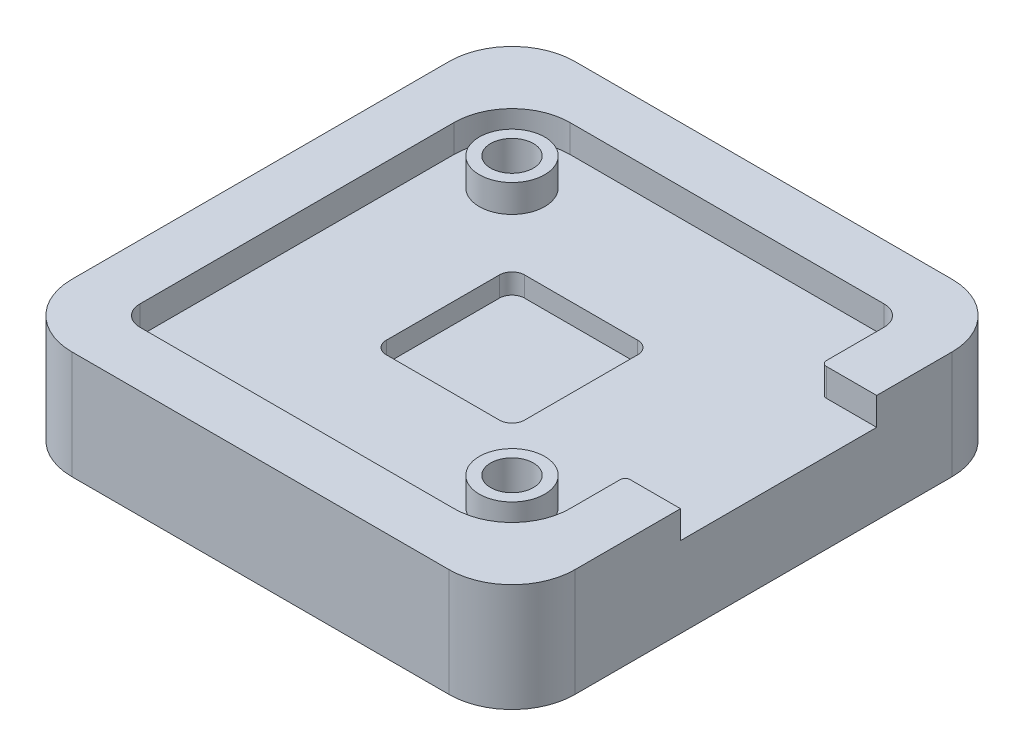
ISO-10303-21;
HEADER;
FILE_DESCRIPTION(('STEP AP214'),'2;1');
FILE_NAME('part.step','',(''),(''),'','','');
FILE_SCHEMA(('AUTOMOTIVE_DESIGN { 1 0 10303 214 1 1 1 1 }'));
ENDSEC;
DATA;
#1=APPLICATION_CONTEXT('core data for automotive mechanical design processes');
#2=APPLICATION_PROTOCOL_DEFINITION('international standard','automotive_design',2000,#1);
#3=PRODUCT_CONTEXT('',#1,'mechanical');
#4=PRODUCT('Part','Part','',(#3));
#5=PRODUCT_RELATED_PRODUCT_CATEGORY('part','',(#4));
#6=PRODUCT_DEFINITION_FORMATION('','',#4);
#7=PRODUCT_DEFINITION_CONTEXT('part definition',#1,'design');
#8=PRODUCT_DEFINITION('design','',#6,#7);
#9=PRODUCT_DEFINITION_SHAPE('','',#8);
#10=(LENGTH_UNIT() NAMED_UNIT(*) SI_UNIT(.MILLI.,.METRE.));
#11=(NAMED_UNIT(*) PLANE_ANGLE_UNIT() SI_UNIT($,.RADIAN.));
#12=(NAMED_UNIT(*) SI_UNIT($,.STERADIAN.) SOLID_ANGLE_UNIT());
#13=UNCERTAINTY_MEASURE_WITH_UNIT(LENGTH_MEASURE(1.E-05),#10,'distance_accuracy_value','');
#14=(GEOMETRIC_REPRESENTATION_CONTEXT(3) GLOBAL_UNCERTAINTY_ASSIGNED_CONTEXT((#13)) GLOBAL_UNIT_ASSIGNED_CONTEXT((#10,
#11,#12)) REPRESENTATION_CONTEXT('',''));
#15=CARTESIAN_POINT('',(0.,0.,0.));
#16=DIRECTION('',(0.,0.,1.));
#17=DIRECTION('',(1.,0.,0.));
#18=AXIS2_PLACEMENT_3D('',#15,#16,#17);
#19=CARTESIAN_POINT('',(7.8,3.2,5.5));
#20=DIRECTION('',(1.,0.,0.));
#21=DIRECTION('',(0.,0.,-1.));
#22=AXIS2_PLACEMENT_3D('',#19,#20,#21);
#23=PLANE('',#22);
#24=DIRECTION('',(0.,0.,-1.));
#25=VECTOR('',#24,1.);
#26=CARTESIAN_POINT('',(7.8,3.2,5.5));
#27=LINE('',#26,#25);
#28=CARTESIAN_POINT('',(7.8,3.2,-4.7));
#29=VERTEX_POINT('',#28);
#30=CARTESIAN_POINT('',(7.8,3.2,-7.));
#31=VERTEX_POINT('',#30);
#32=EDGE_CURVE('E374',#29,#31,#27,.T.);
#33=ORIENTED_EDGE('',*,*,#32,.F.);
#34=DIRECTION('',(0.,-1.,0.));
#35=VECTOR('',#34,1.);
#36=CARTESIAN_POINT('',(7.8,3.2,-4.7));
#37=LINE('',#36,#35);
#38=CARTESIAN_POINT('',(7.8,4.3,-4.7));
#39=VERTEX_POINT('',#38);
#40=EDGE_CURVE('E485',#29,#39,#37,.F.);
#41=ORIENTED_EDGE('',*,*,#40,.T.);
#42=DIRECTION('',(0.,0.,-1.));
#43=VECTOR('',#42,1.);
#44=CARTESIAN_POINT('',(7.8,4.3,5.5));
#45=LINE('',#44,#43);
#46=CARTESIAN_POINT('',(7.8,4.3,-7.));
#47=VERTEX_POINT('',#46);
#48=EDGE_CURVE('E397',#39,#47,#45,.T.);
#49=ORIENTED_EDGE('',*,*,#48,.T.);
#50=DIRECTION('',(0.,1.,0.));
#51=VECTOR('',#50,1.);
#52=CARTESIAN_POINT('',(7.8,3.2,-7.));
#53=LINE('',#52,#51);
#54=EDGE_CURVE('E410',#31,#47,#53,.T.);
#55=ORIENTED_EDGE('',*,*,#54,.F.);
#56=EDGE_LOOP('',(#33,#41,#49,#55));
#57=FACE_BOUND('',#56,.T.);
#58=ADVANCED_FACE('F36',(#57),#23,.F.);
#59=CARTESIAN_POINT('',(7.5,4.3,-7.5));
#60=DIRECTION('',(0.,-1.,0.));
#61=DIRECTION('',(0.,0.,-1.));
#62=AXIS2_PLACEMENT_3D('',#59,#60,#61);
#63=CYLINDRICAL_SURFACE('',#62,2.5);
#64=CARTESIAN_POINT('',(7.5,0.,-7.5));
#65=DIRECTION('',(0.,1.,0.));
#66=DIRECTION('',(0.,0.,1.));
#67=AXIS2_PLACEMENT_3D('',#64,#65,#66);
#68=CIRCLE('',#67,2.5);
#69=CARTESIAN_POINT('',(10.,0.,-7.49999999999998));
#70=VERTEX_POINT('',#69);
#71=CARTESIAN_POINT('',(7.49999999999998,0.,-10.));
#72=VERTEX_POINT('',#71);
#73=EDGE_CURVE('E407',#70,#72,#68,.T.);
#74=ORIENTED_EDGE('',*,*,#73,.T.);
#75=DIRECTION('',(0.,-1.,0.));
#76=VECTOR('',#75,1.);
#77=CARTESIAN_POINT('',(7.49999999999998,4.3,-10.));
#78=LINE('',#77,#76);
#79=CARTESIAN_POINT('',(7.49999999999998,4.3,-10.));
#80=VERTEX_POINT('',#79);
#81=EDGE_CURVE('E479',#80,#72,#78,.T.);
#82=ORIENTED_EDGE('',*,*,#81,.F.);
#83=CARTESIAN_POINT('',(7.5,4.3,-7.5));
#84=DIRECTION('',(0.,1.,0.));
#85=DIRECTION('',(0.,0.,1.));
#86=AXIS2_PLACEMENT_3D('',#83,#84,#85);
#87=CIRCLE('',#86,2.5);
#88=CARTESIAN_POINT('',(10.,4.3,-7.49999999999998));
#89=VERTEX_POINT('',#88);
#90=EDGE_CURVE('E423',#89,#80,#87,.T.);
#91=ORIENTED_EDGE('',*,*,#90,.F.);
#92=DIRECTION('',(0.,-1.,0.));
#93=VECTOR('',#92,1.);
#94=CARTESIAN_POINT('',(10.,4.3,-7.49999999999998));
#95=LINE('',#94,#93);
#96=EDGE_CURVE('E443',#89,#70,#95,.T.);
#97=ORIENTED_EDGE('',*,*,#96,.T.);
#98=EDGE_LOOP('',(#74,#82,#91,#97));
#99=FACE_BOUND('',#98,.T.);
#100=ADVANCED_FACE('F524',(#99),#63,.T.);
#101=CARTESIAN_POINT('',(-7.49999999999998,4.3,-10.));
#102=DIRECTION('',(0.,0.,1.));
#103=DIRECTION('',(1.,0.,0.));
#104=AXIS2_PLACEMENT_3D('',#101,#102,#103);
#105=PLANE('',#104);
#106=DIRECTION('',(-1.,0.,0.));
#107=VECTOR('',#106,1.);
#108=CARTESIAN_POINT('',(-7.49999999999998,0.,-10.));
#109=LINE('',#108,#107);
#110=CARTESIAN_POINT('',(-7.5,0.,-10.));
#111=VERTEX_POINT('',#110);
#112=EDGE_CURVE('E446',#72,#111,#109,.T.);
#113=ORIENTED_EDGE('',*,*,#112,.T.);
#114=DIRECTION('',(0.,-1.,0.));
#115=VECTOR('',#114,1.);
#116=CARTESIAN_POINT('',(-7.5,4.3,-10.));
#117=LINE('',#116,#115);
#118=CARTESIAN_POINT('',(-7.5,4.3,-10.));
#119=VERTEX_POINT('',#118);
#120=EDGE_CURVE('E476',#119,#111,#117,.T.);
#121=ORIENTED_EDGE('',*,*,#120,.F.);
#122=DIRECTION('',(-1.,0.,0.));
#123=VECTOR('',#122,1.);
#124=CARTESIAN_POINT('',(-7.49999999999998,4.3,-10.));
#125=LINE('',#124,#123);
#126=EDGE_CURVE('E426',#80,#119,#125,.T.);
#127=ORIENTED_EDGE('',*,*,#126,.F.);
#128=ORIENTED_EDGE('',*,*,#81,.T.);
#129=EDGE_LOOP('',(#113,#121,#127,#128));
#130=FACE_BOUND('',#129,.T.);
#131=ADVANCED_FACE('F527',(#130),#105,.F.);
#132=CARTESIAN_POINT('',(-7.5,4.3,-7.5));
#133=DIRECTION('',(0.,-1.,0.));
#134=DIRECTION('',(0.,0.,-1.));
#135=AXIS2_PLACEMENT_3D('',#132,#133,#134);
#136=CYLINDRICAL_SURFACE('',#135,2.5);
#137=CARTESIAN_POINT('',(-7.5,0.,-7.5));
#138=DIRECTION('',(0.,1.,0.));
#139=DIRECTION('',(0.,0.,-1.));
#140=AXIS2_PLACEMENT_3D('',#137,#138,#139);
#141=CIRCLE('',#140,2.5);
#142=CARTESIAN_POINT('',(-10.,0.,-7.49999999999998));
#143=VERTEX_POINT('',#142);
#144=EDGE_CURVE('E448',#111,#143,#141,.T.);
#145=ORIENTED_EDGE('',*,*,#144,.T.);
#146=DIRECTION('',(0.,-1.,0.));
#147=VECTOR('',#146,1.);
#148=CARTESIAN_POINT('',(-10.,4.3,-7.49999999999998));
#149=LINE('',#148,#147);
#150=CARTESIAN_POINT('',(-10.,4.3,-7.49999999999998));
#151=VERTEX_POINT('',#150);
#152=EDGE_CURVE('E473',#151,#143,#149,.T.);
#153=ORIENTED_EDGE('',*,*,#152,.F.);
#154=CARTESIAN_POINT('',(-7.5,4.3,-7.5));
#155=DIRECTION('',(0.,1.,0.));
#156=DIRECTION('',(0.,0.,-1.));
#157=AXIS2_PLACEMENT_3D('',#154,#155,#156);
#158=CIRCLE('',#157,2.5);
#159=EDGE_CURVE('E429',#119,#151,#158,.T.);
#160=ORIENTED_EDGE('',*,*,#159,.F.);
#161=ORIENTED_EDGE('',*,*,#120,.T.);
#162=EDGE_LOOP('',(#145,#153,#160,#161));
#163=FACE_BOUND('',#162,.T.);
#164=ADVANCED_FACE('F532',(#163),#136,.T.);
#165=CARTESIAN_POINT('',(-10.,4.3,7.49999999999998));
#166=DIRECTION('',(1.,0.,0.));
#167=DIRECTION('',(0.,0.,-1.));
#168=AXIS2_PLACEMENT_3D('',#165,#166,#167);
#169=PLANE('',#168);
#170=DIRECTION('',(0.,0.,1.));
#171=VECTOR('',#170,1.);
#172=CARTESIAN_POINT('',(-10.,0.,7.49999999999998));
#173=LINE('',#172,#171);
#174=CARTESIAN_POINT('',(-10.,0.,7.49999999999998));
#175=VERTEX_POINT('',#174);
#176=EDGE_CURVE('E450',#143,#175,#173,.T.);
#177=ORIENTED_EDGE('',*,*,#176,.T.);
#178=DIRECTION('',(0.,-1.,0.));
#179=VECTOR('',#178,1.);
#180=CARTESIAN_POINT('',(-10.,4.3,7.49999999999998));
#181=LINE('',#180,#179);
#182=CARTESIAN_POINT('',(-10.,4.3,7.49999999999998));
#183=VERTEX_POINT('',#182);
#184=EDGE_CURVE('E470',#183,#175,#181,.T.);
#185=ORIENTED_EDGE('',*,*,#184,.F.);
#186=DIRECTION('',(0.,0.,1.));
#187=VECTOR('',#186,1.);
#188=CARTESIAN_POINT('',(-10.,4.3,7.49999999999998));
#189=LINE('',#188,#187);
#190=EDGE_CURVE('E431',#151,#183,#189,.T.);
#191=ORIENTED_EDGE('',*,*,#190,.F.);
#192=ORIENTED_EDGE('',*,*,#152,.T.);
#193=EDGE_LOOP('',(#177,#185,#191,#192));
#194=FACE_BOUND('',#193,.T.);
#195=ADVANCED_FACE('F538',(#194),#169,.F.);
#196=CARTESIAN_POINT('',(-7.5,4.3,7.5));
#197=DIRECTION('',(0.,-1.,0.));
#198=DIRECTION('',(0.,0.,-1.));
#199=AXIS2_PLACEMENT_3D('',#196,#197,#198);
#200=CYLINDRICAL_SURFACE('',#199,2.5);
#201=CARTESIAN_POINT('',(-7.5,0.,7.5));
#202=DIRECTION('',(0.,1.,0.));
#203=DIRECTION('',(0.,0.,-1.));
#204=AXIS2_PLACEMENT_3D('',#201,#202,#203);
#205=CIRCLE('',#204,2.5);
#206=CARTESIAN_POINT('',(-7.49999999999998,0.,10.));
#207=VERTEX_POINT('',#206);
#208=EDGE_CURVE('E452',#175,#207,#205,.T.);
#209=ORIENTED_EDGE('',*,*,#208,.T.);
#210=DIRECTION('',(0.,-1.,0.));
#211=VECTOR('',#210,1.);
#212=CARTESIAN_POINT('',(-7.49999999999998,4.3,10.));
#213=LINE('',#212,#211);
#214=CARTESIAN_POINT('',(-7.49999999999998,4.3,10.));
#215=VERTEX_POINT('',#214);
#216=EDGE_CURVE('E467',#215,#207,#213,.T.);
#217=ORIENTED_EDGE('',*,*,#216,.F.);
#218=CARTESIAN_POINT('',(-7.5,4.3,7.5));
#219=DIRECTION('',(0.,1.,0.));
#220=DIRECTION('',(0.,0.,-1.));
#221=AXIS2_PLACEMENT_3D('',#218,#219,#220);
#222=CIRCLE('',#221,2.5);
#223=EDGE_CURVE('E433',#183,#215,#222,.T.);
#224=ORIENTED_EDGE('',*,*,#223,.F.);
#225=ORIENTED_EDGE('',*,*,#184,.T.);
#226=EDGE_LOOP('',(#209,#217,#224,#225));
#227=FACE_BOUND('',#226,.T.);
#228=ADVANCED_FACE('F542',(#227),#200,.T.);
#229=CARTESIAN_POINT('',(-7.49999999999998,4.3,10.));
#230=DIRECTION('',(0.,0.,-1.));
#231=DIRECTION('',(-1.,0.,0.));
#232=AXIS2_PLACEMENT_3D('',#229,#230,#231);
#233=PLANE('',#232);
#234=DIRECTION('',(1.,0.,0.));
#235=VECTOR('',#234,1.);
#236=CARTESIAN_POINT('',(-7.49999999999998,0.,10.));
#237=LINE('',#236,#235);
#238=CARTESIAN_POINT('',(7.49999999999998,0.,10.));
#239=VERTEX_POINT('',#238);
#240=EDGE_CURVE('E454',#207,#239,#237,.T.);
#241=ORIENTED_EDGE('',*,*,#240,.T.);
#242=DIRECTION('',(0.,-1.,0.));
#243=VECTOR('',#242,1.);
#244=CARTESIAN_POINT('',(7.49999999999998,4.3,10.));
#245=LINE('',#244,#243);
#246=CARTESIAN_POINT('',(7.49999999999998,4.3,10.));
#247=VERTEX_POINT('',#246);
#248=EDGE_CURVE('E464',#247,#239,#245,.T.);
#249=ORIENTED_EDGE('',*,*,#248,.F.);
#250=DIRECTION('',(1.,0.,0.));
#251=VECTOR('',#250,1.);
#252=CARTESIAN_POINT('',(-7.49999999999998,4.3,10.));
#253=LINE('',#252,#251);
#254=EDGE_CURVE('E435',#215,#247,#253,.T.);
#255=ORIENTED_EDGE('',*,*,#254,.F.);
#256=ORIENTED_EDGE('',*,*,#216,.T.);
#257=EDGE_LOOP('',(#241,#249,#255,#256));
#258=FACE_BOUND('',#257,.T.);
#259=ADVANCED_FACE('F547',(#258),#233,.F.);
#260=CARTESIAN_POINT('',(7.5,4.3,7.5));
#261=DIRECTION('',(0.,-1.,0.));
#262=DIRECTION('',(0.,0.,-1.));
#263=AXIS2_PLACEMENT_3D('',#260,#261,#262);
#264=CYLINDRICAL_SURFACE('',#263,2.5);
#265=CARTESIAN_POINT('',(7.5,0.,7.5));
#266=DIRECTION('',(0.,1.,0.));
#267=DIRECTION('',(0.,0.,-1.));
#268=AXIS2_PLACEMENT_3D('',#265,#266,#267);
#269=CIRCLE('',#268,2.5);
#270=CARTESIAN_POINT('',(10.,0.,7.49999999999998));
#271=VERTEX_POINT('',#270);
#272=EDGE_CURVE('E456',#239,#271,#269,.T.);
#273=ORIENTED_EDGE('',*,*,#272,.T.);
#274=DIRECTION('',(0.,-1.,0.));
#275=VECTOR('',#274,1.);
#276=CARTESIAN_POINT('',(10.,4.3,7.49999999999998));
#277=LINE('',#276,#275);
#278=CARTESIAN_POINT('',(10.,4.3,7.49999999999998));
#279=VERTEX_POINT('',#278);
#280=EDGE_CURVE('E461',#279,#271,#277,.T.);
#281=ORIENTED_EDGE('',*,*,#280,.F.);
#282=CARTESIAN_POINT('',(7.5,4.3,7.5));
#283=DIRECTION('',(0.,1.,0.));
#284=DIRECTION('',(0.,0.,-1.));
#285=AXIS2_PLACEMENT_3D('',#282,#283,#284);
#286=CIRCLE('',#285,2.5);
#287=EDGE_CURVE('E437',#247,#279,#286,.T.);
#288=ORIENTED_EDGE('',*,*,#287,.F.);
#289=ORIENTED_EDGE('',*,*,#248,.T.);
#290=EDGE_LOOP('',(#273,#281,#288,#289));
#291=FACE_BOUND('',#290,.T.);
#292=ADVANCED_FACE('F553',(#291),#264,.T.);
#293=CARTESIAN_POINT('',(10.,4.3,7.49999999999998));
#294=DIRECTION('',(-1.,0.,0.));
#295=DIRECTION('',(0.,0.,1.));
#296=AXIS2_PLACEMENT_3D('',#293,#294,#295);
#297=PLANE('',#296);
#298=DIRECTION('',(0.,0.,-1.));
#299=VECTOR('',#298,1.);
#300=CARTESIAN_POINT('',(10.,4.3,7.49999999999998));
#301=LINE('',#300,#299);
#302=CARTESIAN_POINT('',(10.,4.3,-4.5));
#303=VERTEX_POINT('',#302);
#304=EDGE_CURVE('E439',#303,#89,#301,.T.);
#305=ORIENTED_EDGE('',*,*,#304,.F.);
#306=DIRECTION('',(0.,1.,0.));
#307=VECTOR('',#306,1.);
#308=CARTESIAN_POINT('',(10.,3.2,-4.5));
#309=LINE('',#308,#307);
#310=CARTESIAN_POINT('',(10.,3.2,-4.5));
#311=VERTEX_POINT('',#310);
#312=EDGE_CURVE('E334',#311,#303,#309,.T.);
#313=ORIENTED_EDGE('',*,*,#312,.F.);
#314=DIRECTION('',(0.,0.,-1.));
#315=VECTOR('',#314,1.);
#316=CARTESIAN_POINT('',(10.,3.2,3.3));
#317=LINE('',#316,#315);
#318=CARTESIAN_POINT('',(10.,3.2,3.3));
#319=VERTEX_POINT('',#318);
#320=EDGE_CURVE('E331',#319,#311,#317,.T.);
#321=ORIENTED_EDGE('',*,*,#320,.F.);
#322=DIRECTION('',(0.,-1.,0.));
#323=VECTOR('',#322,1.);
#324=CARTESIAN_POINT('',(10.,6.2,3.3));
#325=LINE('',#324,#323);
#326=CARTESIAN_POINT('',(10.,4.3,3.3));
#327=VERTEX_POINT('',#326);
#328=EDGE_CURVE('E328',#327,#319,#325,.T.);
#329=ORIENTED_EDGE('',*,*,#328,.F.);
#330=EDGE_CURVE('E440',#279,#327,#301,.T.);
#331=ORIENTED_EDGE('',*,*,#330,.F.);
#332=ORIENTED_EDGE('',*,*,#280,.T.);
#333=DIRECTION('',(0.,0.,-1.));
#334=VECTOR('',#333,1.);
#335=CARTESIAN_POINT('',(10.,0.,7.49999999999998));
#336=LINE('',#335,#334);
#337=EDGE_CURVE('E427',#271,#70,#336,.T.);
#338=ORIENTED_EDGE('',*,*,#337,.T.);
#339=ORIENTED_EDGE('',*,*,#96,.F.);
#340=EDGE_LOOP('',(#305,#313,#321,#329,#331,#332,#338,#339));
#341=FACE_BOUND('',#340,.T.);
#342=ADVANCED_FACE('F517',(#341),#297,.F.);
#343=CARTESIAN_POINT('',(7.5,4.3,-7.5));
#344=DIRECTION('',(0.,1.,0.));
#345=DIRECTION('',(0.,0.,1.));
#346=AXIS2_PLACEMENT_3D('',#343,#344,#345);
#347=PLANE('',#346);
#348=ORIENTED_EDGE('',*,*,#48,.F.);
#349=CARTESIAN_POINT('',(8.,4.3,-4.7));
#350=DIRECTION('',(0.,1.,0.));
#351=DIRECTION('',(0.,0.,1.));
#352=AXIS2_PLACEMENT_3D('',#349,#350,#351);
#353=CIRCLE('',#352,0.2);
#354=CARTESIAN_POINT('',(8.,4.3,-4.5));
#355=VERTEX_POINT('',#354);
#356=EDGE_CURVE('E489',#39,#355,#353,.T.);
#357=ORIENTED_EDGE('',*,*,#356,.T.);
#358=DIRECTION('',(-1.,0.,0.));
#359=VECTOR('',#358,1.);
#360=CARTESIAN_POINT('',(7.5,4.3,-4.5));
#361=LINE('',#360,#359);
#362=EDGE_CURVE('E342',#303,#355,#361,.T.);
#363=ORIENTED_EDGE('',*,*,#362,.F.);
#364=ORIENTED_EDGE('',*,*,#304,.T.);
#365=ORIENTED_EDGE('',*,*,#90,.T.);
#366=ORIENTED_EDGE('',*,*,#126,.T.);
#367=ORIENTED_EDGE('',*,*,#159,.T.);
#368=ORIENTED_EDGE('',*,*,#190,.T.);
#369=ORIENTED_EDGE('',*,*,#223,.T.);
#370=ORIENTED_EDGE('',*,*,#254,.T.);
#371=ORIENTED_EDGE('',*,*,#287,.T.);
#372=ORIENTED_EDGE('',*,*,#330,.T.);
#373=DIRECTION('',(1.,0.,0.));
#374=VECTOR('',#373,1.);
#375=CARTESIAN_POINT('',(7.5,4.3,3.3));
#376=LINE('',#375,#374);
#377=CARTESIAN_POINT('',(8.,4.3,3.3));
#378=VERTEX_POINT('',#377);
#379=EDGE_CURVE('E339',#378,#327,#376,.T.);
#380=ORIENTED_EDGE('',*,*,#379,.F.);
#381=CARTESIAN_POINT('',(8.,4.3,3.5));
#382=DIRECTION('',(0.,1.,0.));
#383=DIRECTION('',(0.,0.,1.));
#384=AXIS2_PLACEMENT_3D('',#381,#382,#383);
#385=CIRCLE('',#384,0.2);
#386=CARTESIAN_POINT('',(7.8,4.3,3.5));
#387=VERTEX_POINT('',#386);
#388=EDGE_CURVE('E487',#378,#387,#385,.T.);
#389=ORIENTED_EDGE('',*,*,#388,.T.);
#390=CARTESIAN_POINT('',(7.8,4.3,5.5));
#391=VERTEX_POINT('',#390);
#392=EDGE_CURVE('E398',#391,#387,#45,.T.);
#393=ORIENTED_EDGE('',*,*,#392,.F.);
#394=CARTESIAN_POINT('',(5.5,4.3,5.5));
#395=DIRECTION('',(0.,1.,0.));
#396=DIRECTION('',(0.,0.,-1.));
#397=AXIS2_PLACEMENT_3D('',#394,#395,#396);
#398=CIRCLE('',#397,2.3);
#399=CARTESIAN_POINT('',(5.5,4.3,7.8));
#400=VERTEX_POINT('',#399);
#401=EDGE_CURVE('E394',#400,#391,#398,.T.);
#402=ORIENTED_EDGE('',*,*,#401,.F.);
#403=DIRECTION('',(1.,0.,0.));
#404=VECTOR('',#403,1.);
#405=CARTESIAN_POINT('',(-7.,4.3,7.8));
#406=LINE('',#405,#404);
#407=CARTESIAN_POINT('',(-7.,4.3,7.8));
#408=VERTEX_POINT('',#407);
#409=EDGE_CURVE('E391',#408,#400,#406,.T.);
#410=ORIENTED_EDGE('',*,*,#409,.F.);
#411=CARTESIAN_POINT('',(-7.,4.3,7.));
#412=DIRECTION('',(0.,1.,0.));
#413=DIRECTION('',(0.,0.,-1.));
#414=AXIS2_PLACEMENT_3D('',#411,#412,#413);
#415=CIRCLE('',#414,0.8);
#416=CARTESIAN_POINT('',(-7.8,4.3,7.));
#417=VERTEX_POINT('',#416);
#418=EDGE_CURVE('E388',#417,#408,#415,.T.);
#419=ORIENTED_EDGE('',*,*,#418,.F.);
#420=DIRECTION('',(0.,0.,1.));
#421=VECTOR('',#420,1.);
#422=CARTESIAN_POINT('',(-7.8,4.3,7.));
#423=LINE('',#422,#421);
#424=CARTESIAN_POINT('',(-7.8,4.3,-5.5));
#425=VERTEX_POINT('',#424);
#426=EDGE_CURVE('E385',#425,#417,#423,.T.);
#427=ORIENTED_EDGE('',*,*,#426,.F.);
#428=CARTESIAN_POINT('',(-5.5,4.3,-5.5));
#429=DIRECTION('',(0.,1.,0.));
#430=DIRECTION('',(0.,0.,1.));
#431=AXIS2_PLACEMENT_3D('',#428,#429,#430);
#432=CIRCLE('',#431,2.3);
#433=CARTESIAN_POINT('',(-5.5,4.3,-7.8));
#434=VERTEX_POINT('',#433);
#435=EDGE_CURVE('E355',#434,#425,#432,.T.);
#436=ORIENTED_EDGE('',*,*,#435,.F.);
#437=DIRECTION('',(-1.,0.,0.));
#438=VECTOR('',#437,1.);
#439=CARTESIAN_POINT('',(7.,4.3,-7.8));
#440=LINE('',#439,#438);
#441=CARTESIAN_POINT('',(7.,4.3,-7.8));
#442=VERTEX_POINT('',#441);
#443=EDGE_CURVE('E362',#442,#434,#440,.T.);
#444=ORIENTED_EDGE('',*,*,#443,.F.);
#445=CARTESIAN_POINT('',(7.,4.3,-7.));
#446=DIRECTION('',(0.,1.,0.));
#447=DIRECTION('',(0.,0.,-1.));
#448=AXIS2_PLACEMENT_3D('',#445,#446,#447);
#449=CIRCLE('',#448,0.8);
#450=EDGE_CURVE('E400',#47,#442,#449,.T.);
#451=ORIENTED_EDGE('',*,*,#450,.F.);
#452=EDGE_LOOP('',(#348,#357,#363,#364,#365,#366,#367,#368,#369,#370,#371,#372,#380,#389,#393,
#402,#410,#419,#427,#436,#444,#451));
#453=FACE_BOUND('',#452,.T.);
#454=ADVANCED_FACE('F509',(#453),#347,.T.);
#455=CARTESIAN_POINT('',(7.5,0.,-7.5));
#456=DIRECTION('',(0.,1.,0.));
#457=DIRECTION('',(0.,0.,1.));
#458=AXIS2_PLACEMENT_3D('',#455,#456,#457);
#459=PLANE('',#458);
#460=CARTESIAN_POINT('',(5.5,0.,5.5));
#461=DIRECTION('',(0.,-1.,0.));
#462=DIRECTION('',(0.,0.,-1.));
#463=AXIS2_PLACEMENT_3D('',#460,#461,#462);
#464=CIRCLE('',#463,1.75);
#465=CARTESIAN_POINT('',(5.5,0.,3.75));
#466=VERTEX_POINT('',#465);
#467=EDGE_CURVE('E293',#466,#466,#464,.T.);
#468=ORIENTED_EDGE('',*,*,#467,.F.);
#469=EDGE_LOOP('',(#468));
#470=FACE_BOUND('',#469,.T.);
#471=CARTESIAN_POINT('',(-5.5,0.,-5.5));
#472=DIRECTION('',(0.,-1.,0.));
#473=DIRECTION('',(0.,0.,-1.));
#474=AXIS2_PLACEMENT_3D('',#471,#472,#473);
#475=CIRCLE('',#474,1.75);
#476=CARTESIAN_POINT('',(-5.5,0.,-7.25));
#477=VERTEX_POINT('',#476);
#478=EDGE_CURVE('E316',#477,#477,#475,.T.);
#479=ORIENTED_EDGE('',*,*,#478,.F.);
#480=EDGE_LOOP('',(#479));
#481=FACE_BOUND('',#480,.T.);
#482=ORIENTED_EDGE('',*,*,#73,.F.);
#483=ORIENTED_EDGE('',*,*,#337,.F.);
#484=ORIENTED_EDGE('',*,*,#272,.F.);
#485=ORIENTED_EDGE('',*,*,#240,.F.);
#486=ORIENTED_EDGE('',*,*,#208,.F.);
#487=ORIENTED_EDGE('',*,*,#176,.F.);
#488=ORIENTED_EDGE('',*,*,#144,.F.);
#489=ORIENTED_EDGE('',*,*,#112,.F.);
#490=EDGE_LOOP('',(#482,#483,#484,#485,#486,#487,#488,#489));
#491=FACE_BOUND('',#490,.T.);
#492=ADVANCED_FACE('F614',(#470,#481,#491),#459,.F.);
#493=CARTESIAN_POINT('',(-5.5,3.2,-5.5));
#494=DIRECTION('',(0.,1.,0.));
#495=DIRECTION('',(0.,0.,1.));
#496=AXIS2_PLACEMENT_3D('',#493,#494,#495);
#497=CYLINDRICAL_SURFACE('',#496,2.3);
#498=ORIENTED_EDGE('',*,*,#435,.T.);
#499=DIRECTION('',(0.,1.,0.));
#500=VECTOR('',#499,1.);
#501=CARTESIAN_POINT('',(-7.8,3.2,-5.5));
#502=LINE('',#501,#500);
#503=CARTESIAN_POINT('',(-7.8,3.2,-5.5));
#504=VERTEX_POINT('',#503);
#505=EDGE_CURVE('E383',#504,#425,#502,.T.);
#506=ORIENTED_EDGE('',*,*,#505,.F.);
#507=CARTESIAN_POINT('',(-5.5,3.2,-5.5));
#508=DIRECTION('',(0.,1.,0.));
#509=DIRECTION('',(0.,0.,1.));
#510=AXIS2_PLACEMENT_3D('',#507,#508,#509);
#511=CIRCLE('',#510,2.3);
#512=CARTESIAN_POINT('',(-5.5,3.2,-7.8));
#513=VERTEX_POINT('',#512);
#514=EDGE_CURVE('E358',#513,#504,#511,.T.);
#515=ORIENTED_EDGE('',*,*,#514,.F.);
#516=DIRECTION('',(0.,1.,0.));
#517=VECTOR('',#516,1.);
#518=CARTESIAN_POINT('',(-5.5,3.2,-7.8));
#519=LINE('',#518,#517);
#520=EDGE_CURVE('E405',#513,#434,#519,.T.);
#521=ORIENTED_EDGE('',*,*,#520,.T.);
#522=EDGE_LOOP('',(#498,#506,#515,#521));
#523=FACE_BOUND('',#522,.T.);
#524=ADVANCED_FACE('F583',(#523),#497,.F.);
#525=CARTESIAN_POINT('',(7.,3.2,-7.8));
#526=DIRECTION('',(0.,0.,-1.));
#527=DIRECTION('',(-1.,0.,0.));
#528=AXIS2_PLACEMENT_3D('',#525,#526,#527);
#529=PLANE('',#528);
#530=ORIENTED_EDGE('',*,*,#443,.T.);
#531=ORIENTED_EDGE('',*,*,#520,.F.);
#532=DIRECTION('',(-1.,0.,0.));
#533=VECTOR('',#532,1.);
#534=CARTESIAN_POINT('',(7.,3.2,-7.8));
#535=LINE('',#534,#533);
#536=CARTESIAN_POINT('',(7.,3.2,-7.8));
#537=VERTEX_POINT('',#536);
#538=EDGE_CURVE('E380',#537,#513,#535,.T.);
#539=ORIENTED_EDGE('',*,*,#538,.F.);
#540=DIRECTION('',(0.,1.,0.));
#541=VECTOR('',#540,1.);
#542=CARTESIAN_POINT('',(7.,3.2,-7.8));
#543=LINE('',#542,#541);
#544=EDGE_CURVE('E408',#537,#442,#543,.T.);
#545=ORIENTED_EDGE('',*,*,#544,.T.);
#546=EDGE_LOOP('',(#530,#531,#539,#545));
#547=FACE_BOUND('',#546,.T.);
#548=ADVANCED_FACE('F587',(#547),#529,.F.);
#549=CARTESIAN_POINT('',(7.,3.2,-7.));
#550=DIRECTION('',(0.,1.,0.));
#551=DIRECTION('',(0.,0.,1.));
#552=AXIS2_PLACEMENT_3D('',#549,#550,#551);
#553=CYLINDRICAL_SURFACE('',#552,0.8);
#554=ORIENTED_EDGE('',*,*,#450,.T.);
#555=ORIENTED_EDGE('',*,*,#544,.F.);
#556=CARTESIAN_POINT('',(7.,3.2,-7.));
#557=DIRECTION('',(0.,1.,0.));
#558=DIRECTION('',(0.,0.,-1.));
#559=AXIS2_PLACEMENT_3D('',#556,#557,#558);
#560=CIRCLE('',#559,0.8);
#561=EDGE_CURVE('E377',#31,#537,#560,.T.);
#562=ORIENTED_EDGE('',*,*,#561,.F.);
#563=ORIENTED_EDGE('',*,*,#54,.T.);
#564=EDGE_LOOP('',(#554,#555,#562,#563));
#565=FACE_BOUND('',#564,.T.);
#566=ADVANCED_FACE('F589',(#565),#553,.F.);
#567=ORIENTED_EDGE('',*,*,#392,.T.);
#568=DIRECTION('',(0.,1.,0.));
#569=VECTOR('',#568,1.);
#570=CARTESIAN_POINT('',(7.8,3.2,3.5));
#571=LINE('',#570,#569);
#572=CARTESIAN_POINT('',(7.8,3.2,3.5));
#573=VERTEX_POINT('',#572);
#574=EDGE_CURVE('E59',#387,#573,#571,.F.);
#575=ORIENTED_EDGE('',*,*,#574,.T.);
#576=CARTESIAN_POINT('',(7.8,3.2,5.5));
#577=VERTEX_POINT('',#576);
#578=EDGE_CURVE('E375',#577,#573,#27,.T.);
#579=ORIENTED_EDGE('',*,*,#578,.F.);
#580=DIRECTION('',(0.,1.,0.));
#581=VECTOR('',#580,1.);
#582=CARTESIAN_POINT('',(7.8,3.2,5.5));
#583=LINE('',#582,#581);
#584=EDGE_CURVE('E413',#577,#391,#583,.T.);
#585=ORIENTED_EDGE('',*,*,#584,.T.);
#586=EDGE_LOOP('',(#567,#575,#579,#585));
#587=FACE_BOUND('',#586,.T.);
#588=ADVANCED_FACE('F563',(#587),#23,.F.);
#589=CARTESIAN_POINT('',(5.5,3.2,5.5));
#590=DIRECTION('',(0.,1.,0.));
#591=DIRECTION('',(0.,0.,1.));
#592=AXIS2_PLACEMENT_3D('',#589,#590,#591);
#593=CYLINDRICAL_SURFACE('',#592,2.3);
#594=ORIENTED_EDGE('',*,*,#401,.T.);
#595=ORIENTED_EDGE('',*,*,#584,.F.);
#596=CARTESIAN_POINT('',(5.5,3.2,5.5));
#597=DIRECTION('',(0.,1.,0.));
#598=DIRECTION('',(0.,0.,-1.));
#599=AXIS2_PLACEMENT_3D('',#596,#597,#598);
#600=CIRCLE('',#599,2.3);
#601=CARTESIAN_POINT('',(5.5,3.2,7.8));
#602=VERTEX_POINT('',#601);
#603=EDGE_CURVE('E371',#602,#577,#600,.T.);
#604=ORIENTED_EDGE('',*,*,#603,.F.);
#605=DIRECTION('',(0.,1.,0.));
#606=VECTOR('',#605,1.);
#607=CARTESIAN_POINT('',(5.5,3.2,7.8));
#608=LINE('',#607,#606);
#609=EDGE_CURVE('E415',#602,#400,#608,.T.);
#610=ORIENTED_EDGE('',*,*,#609,.T.);
#611=EDGE_LOOP('',(#594,#595,#604,#610));
#612=FACE_BOUND('',#611,.T.);
#613=ADVANCED_FACE('F568',(#612),#593,.F.);
#614=CARTESIAN_POINT('',(-7.,3.2,7.8));
#615=DIRECTION('',(0.,0.,1.));
#616=DIRECTION('',(1.,0.,0.));
#617=AXIS2_PLACEMENT_3D('',#614,#615,#616);
#618=PLANE('',#617);
#619=ORIENTED_EDGE('',*,*,#409,.T.);
#620=ORIENTED_EDGE('',*,*,#609,.F.);
#621=DIRECTION('',(1.,0.,0.));
#622=VECTOR('',#621,1.);
#623=CARTESIAN_POINT('',(-7.,3.2,7.8));
#624=LINE('',#623,#622);
#625=CARTESIAN_POINT('',(-7.,3.2,7.8));
#626=VERTEX_POINT('',#625);
#627=EDGE_CURVE('E368',#626,#602,#624,.T.);
#628=ORIENTED_EDGE('',*,*,#627,.F.);
#629=DIRECTION('',(0.,1.,0.));
#630=VECTOR('',#629,1.);
#631=CARTESIAN_POINT('',(-7.,3.2,7.8));
#632=LINE('',#631,#630);
#633=EDGE_CURVE('E417',#626,#408,#632,.T.);
#634=ORIENTED_EDGE('',*,*,#633,.T.);
#635=EDGE_LOOP('',(#619,#620,#628,#634));
#636=FACE_BOUND('',#635,.T.);
#637=ADVANCED_FACE('F573',(#636),#618,.F.);
#638=CARTESIAN_POINT('',(-7.,3.2,7.));
#639=DIRECTION('',(0.,1.,0.));
#640=DIRECTION('',(0.,0.,1.));
#641=AXIS2_PLACEMENT_3D('',#638,#639,#640);
#642=CYLINDRICAL_SURFACE('',#641,0.8);
#643=ORIENTED_EDGE('',*,*,#418,.T.);
#644=ORIENTED_EDGE('',*,*,#633,.F.);
#645=CARTESIAN_POINT('',(-7.,3.2,7.));
#646=DIRECTION('',(0.,1.,0.));
#647=DIRECTION('',(0.,0.,-1.));
#648=AXIS2_PLACEMENT_3D('',#645,#646,#647);
#649=CIRCLE('',#648,0.8);
#650=CARTESIAN_POINT('',(-7.8,3.2,7.));
#651=VERTEX_POINT('',#650);
#652=EDGE_CURVE('E365',#651,#626,#649,.T.);
#653=ORIENTED_EDGE('',*,*,#652,.F.);
#654=DIRECTION('',(0.,1.,0.));
#655=VECTOR('',#654,1.);
#656=CARTESIAN_POINT('',(-7.8,3.2,7.));
#657=LINE('',#656,#655);
#658=EDGE_CURVE('E419',#651,#417,#657,.T.);
#659=ORIENTED_EDGE('',*,*,#658,.T.);
#660=EDGE_LOOP('',(#643,#644,#653,#659));
#661=FACE_BOUND('',#660,.T.);
#662=ADVANCED_FACE('F576',(#661),#642,.F.);
#663=CARTESIAN_POINT('',(-7.8,3.2,7.));
#664=DIRECTION('',(-1.,0.,0.));
#665=DIRECTION('',(0.,0.,1.));
#666=AXIS2_PLACEMENT_3D('',#663,#664,#665);
#667=PLANE('',#666);
#668=ORIENTED_EDGE('',*,*,#426,.T.);
#669=ORIENTED_EDGE('',*,*,#658,.F.);
#670=DIRECTION('',(0.,0.,1.));
#671=VECTOR('',#670,1.);
#672=CARTESIAN_POINT('',(-7.8,3.2,7.));
#673=LINE('',#672,#671);
#674=EDGE_CURVE('E361',#504,#651,#673,.T.);
#675=ORIENTED_EDGE('',*,*,#674,.F.);
#676=ORIENTED_EDGE('',*,*,#505,.T.);
#677=EDGE_LOOP('',(#668,#669,#675,#676));
#678=FACE_BOUND('',#677,.T.);
#679=ADVANCED_FACE('F579',(#678),#667,.F.);
#680=CARTESIAN_POINT('',(-5.5,3.2,-5.5));
#681=DIRECTION('',(0.,1.,0.));
#682=DIRECTION('',(0.,0.,1.));
#683=AXIS2_PLACEMENT_3D('',#680,#681,#682);
#684=PLANE('',#683);
#685=CARTESIAN_POINT('',(-2.25,3.2,-2.25));
#686=DIRECTION('',(0.,1.,0.));
#687=DIRECTION('',(0.,0.,1.));
#688=AXIS2_PLACEMENT_3D('',#685,#686,#687);
#689=CIRCLE('',#688,0.5);
#690=CARTESIAN_POINT('',(-2.25,3.2,-2.75));
#691=VERTEX_POINT('',#690);
#692=CARTESIAN_POINT('',(-2.75,3.2,-2.25));
#693=VERTEX_POINT('',#692);
#694=EDGE_CURVE('E51',#691,#693,#689,.T.);
#695=ORIENTED_EDGE('',*,*,#694,.F.);
#696=DIRECTION('',(-1.,0.,0.));
#697=VECTOR('',#696,1.);
#698=CARTESIAN_POINT('',(2.25,3.2,-2.75));
#699=LINE('',#698,#697);
#700=CARTESIAN_POINT('',(2.25,3.2,-2.75));
#701=VERTEX_POINT('',#700);
#702=EDGE_CURVE('E255',#701,#691,#699,.T.);
#703=ORIENTED_EDGE('',*,*,#702,.F.);
#704=CARTESIAN_POINT('',(2.25,3.2,-2.25));
#705=DIRECTION('',(0.,1.,0.));
#706=DIRECTION('',(0.,0.,-1.));
#707=AXIS2_PLACEMENT_3D('',#704,#705,#706);
#708=CIRCLE('',#707,0.5);
#709=CARTESIAN_POINT('',(2.75,3.2,-2.25));
#710=VERTEX_POINT('',#709);
#711=EDGE_CURVE('E258',#710,#701,#708,.T.);
#712=ORIENTED_EDGE('',*,*,#711,.F.);
#713=DIRECTION('',(0.,0.,-1.));
#714=VECTOR('',#713,1.);
#715=CARTESIAN_POINT('',(2.75,3.2,2.25));
#716=LINE('',#715,#714);
#717=CARTESIAN_POINT('',(2.75,3.2,2.25));
#718=VERTEX_POINT('',#717);
#719=EDGE_CURVE('E286',#718,#710,#716,.T.);
#720=ORIENTED_EDGE('',*,*,#719,.F.);
#721=CARTESIAN_POINT('',(2.25,3.2,2.25));
#722=DIRECTION('',(0.,1.,0.));
#723=DIRECTION('',(0.,0.,-1.));
#724=AXIS2_PLACEMENT_3D('',#721,#722,#723);
#725=CIRCLE('',#724,0.5);
#726=CARTESIAN_POINT('',(2.25,3.2,2.75));
#727=VERTEX_POINT('',#726);
#728=EDGE_CURVE('E283',#727,#718,#725,.T.);
#729=ORIENTED_EDGE('',*,*,#728,.F.);
#730=DIRECTION('',(1.,0.,0.));
#731=VECTOR('',#730,1.);
#732=CARTESIAN_POINT('',(2.25,3.2,2.75));
#733=LINE('',#732,#731);
#734=CARTESIAN_POINT('',(-2.25,3.2,2.75));
#735=VERTEX_POINT('',#734);
#736=EDGE_CURVE('E280',#735,#727,#733,.T.);
#737=ORIENTED_EDGE('',*,*,#736,.F.);
#738=CARTESIAN_POINT('',(-2.25,3.2,2.25));
#739=DIRECTION('',(0.,1.,0.));
#740=DIRECTION('',(0.,0.,-1.));
#741=AXIS2_PLACEMENT_3D('',#738,#739,#740);
#742=CIRCLE('',#741,0.5);
#743=CARTESIAN_POINT('',(-2.75,3.2,2.25));
#744=VERTEX_POINT('',#743);
#745=EDGE_CURVE('E277',#744,#735,#742,.T.);
#746=ORIENTED_EDGE('',*,*,#745,.F.);
#747=DIRECTION('',(0.,0.,1.));
#748=VECTOR('',#747,1.);
#749=CARTESIAN_POINT('',(-2.75,3.2,2.25));
#750=LINE('',#749,#748);
#751=EDGE_CURVE('E275',#693,#744,#750,.T.);
#752=ORIENTED_EDGE('',*,*,#751,.F.);
#753=EDGE_LOOP('',(#695,#703,#712,#720,#729,#737,#746,#752));
#754=FACE_BOUND('',#753,.T.);
#755=CARTESIAN_POINT('',(5.5,3.2,5.5));
#756=DIRECTION('',(0.,1.,0.));
#757=DIRECTION('',(0.,0.,1.));
#758=AXIS2_PLACEMENT_3D('',#755,#756,#757);
#759=CIRCLE('',#758,1.3);
#760=CARTESIAN_POINT('',(5.5,3.2,6.8));
#761=VERTEX_POINT('',#760);
#762=EDGE_CURVE('E346',#761,#761,#759,.T.);
#763=ORIENTED_EDGE('',*,*,#762,.F.);
#764=EDGE_LOOP('',(#763));
#765=FACE_BOUND('',#764,.T.);
#766=CARTESIAN_POINT('',(-5.5,3.2,-5.5));
#767=DIRECTION('',(0.,1.,0.));
#768=DIRECTION('',(0.,0.,1.));
#769=AXIS2_PLACEMENT_3D('',#766,#767,#768);
#770=CIRCLE('',#769,1.3);
#771=CARTESIAN_POINT('',(-5.5,3.2,-4.2));
#772=VERTEX_POINT('',#771);
#773=EDGE_CURVE('E352',#772,#772,#770,.T.);
#774=ORIENTED_EDGE('',*,*,#773,.F.);
#775=EDGE_LOOP('',(#774));
#776=FACE_BOUND('',#775,.T.);
#777=ORIENTED_EDGE('',*,*,#514,.T.);
#778=ORIENTED_EDGE('',*,*,#674,.T.);
#779=ORIENTED_EDGE('',*,*,#652,.T.);
#780=ORIENTED_EDGE('',*,*,#627,.T.);
#781=ORIENTED_EDGE('',*,*,#603,.T.);
#782=ORIENTED_EDGE('',*,*,#578,.T.);
#783=CARTESIAN_POINT('',(8.,3.2,3.5));
#784=DIRECTION('',(0.,1.,0.));
#785=DIRECTION('',(0.,0.,1.));
#786=AXIS2_PLACEMENT_3D('',#783,#784,#785);
#787=CIRCLE('',#786,0.2);
#788=CARTESIAN_POINT('',(8.,3.2,3.3));
#789=VERTEX_POINT('',#788);
#790=EDGE_CURVE('E11',#573,#789,#787,.F.);
#791=ORIENTED_EDGE('',*,*,#790,.T.);
#792=DIRECTION('',(1.,0.,0.));
#793=VECTOR('',#792,1.);
#794=CARTESIAN_POINT('',(-0.557032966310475,3.2,3.3));
#795=LINE('',#794,#793);
#796=EDGE_CURVE('E336',#789,#319,#795,.T.);
#797=ORIENTED_EDGE('',*,*,#796,.T.);
#798=ORIENTED_EDGE('',*,*,#320,.T.);
#799=DIRECTION('',(1.,0.,0.));
#800=VECTOR('',#799,1.);
#801=CARTESIAN_POINT('',(-0.557032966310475,3.2,-4.5));
#802=LINE('',#801,#800);
#803=CARTESIAN_POINT('',(8.,3.2,-4.5));
#804=VERTEX_POINT('',#803);
#805=EDGE_CURVE('E337',#804,#311,#802,.T.);
#806=ORIENTED_EDGE('',*,*,#805,.F.);
#807=CARTESIAN_POINT('',(8.,3.2,-4.7));
#808=DIRECTION('',(0.,1.,0.));
#809=DIRECTION('',(0.,0.,1.));
#810=AXIS2_PLACEMENT_3D('',#807,#808,#809);
#811=CIRCLE('',#810,0.2);
#812=EDGE_CURVE('E44',#804,#29,#811,.F.);
#813=ORIENTED_EDGE('',*,*,#812,.T.);
#814=ORIENTED_EDGE('',*,*,#32,.T.);
#815=ORIENTED_EDGE('',*,*,#561,.T.);
#816=ORIENTED_EDGE('',*,*,#538,.T.);
#817=EDGE_LOOP('',(#777,#778,#779,#780,#781,#782,#791,#797,#798,#806,#813,#814,#815,#816));
#818=FACE_BOUND('',#817,.T.);
#819=ADVANCED_FACE('F497',(#754,#765,#776,#818),#684,.T.);
#820=CARTESIAN_POINT('',(-5.5,3.2,-5.5));
#821=DIRECTION('',(0.,1.,0.));
#822=DIRECTION('',(0.,0.,1.));
#823=AXIS2_PLACEMENT_3D('',#820,#821,#822);
#824=CYLINDRICAL_SURFACE('',#823,1.3);
#825=ORIENTED_EDGE('',*,*,#773,.T.);
#826=EDGE_LOOP('',(#825));
#827=FACE_BOUND('',#826,.T.);
#828=CARTESIAN_POINT('',(-5.5,4.3,-5.5));
#829=DIRECTION('',(0.,1.,0.));
#830=DIRECTION('',(0.,0.,1.));
#831=AXIS2_PLACEMENT_3D('',#828,#829,#830);
#832=CIRCLE('',#831,1.3);
#833=CARTESIAN_POINT('',(-5.5,4.3,-4.2));
#834=VERTEX_POINT('',#833);
#835=EDGE_CURVE('E349',#834,#834,#832,.T.);
#836=ORIENTED_EDGE('',*,*,#835,.F.);
#837=EDGE_LOOP('',(#836));
#838=FACE_BOUND('',#837,.T.);
#839=ADVANCED_FACE('F677',(#827,#838),#824,.T.);
#840=CARTESIAN_POINT('',(5.5,3.2,5.5));
#841=DIRECTION('',(0.,1.,0.));
#842=DIRECTION('',(0.,0.,1.));
#843=AXIS2_PLACEMENT_3D('',#840,#841,#842);
#844=CYLINDRICAL_SURFACE('',#843,1.3);
#845=ORIENTED_EDGE('',*,*,#762,.T.);
#846=EDGE_LOOP('',(#845));
#847=FACE_BOUND('',#846,.T.);
#848=CARTESIAN_POINT('',(5.5,4.3,5.5));
#849=DIRECTION('',(0.,1.,0.));
#850=DIRECTION('',(0.,0.,1.));
#851=AXIS2_PLACEMENT_3D('',#848,#849,#850);
#852=CIRCLE('',#851,1.3);
#853=CARTESIAN_POINT('',(5.5,4.3,6.8));
#854=VERTEX_POINT('',#853);
#855=EDGE_CURVE('E345',#854,#854,#852,.T.);
#856=ORIENTED_EDGE('',*,*,#855,.F.);
#857=EDGE_LOOP('',(#856));
#858=FACE_BOUND('',#857,.T.);
#859=ADVANCED_FACE('F674',(#847,#858),#844,.T.);
#860=CARTESIAN_POINT('',(-5.5,4.3,-5.5));
#861=DIRECTION('',(0.,1.,0.));
#862=DIRECTION('',(0.,0.,1.));
#863=AXIS2_PLACEMENT_3D('',#860,#861,#862);
#864=CIRCLE('',#863,0.85);
#865=CARTESIAN_POINT('',(-5.5,4.3,-4.65));
#866=VERTEX_POINT('',#865);
#867=EDGE_CURVE('E325',#866,#866,#864,.T.);
#868=ORIENTED_EDGE('',*,*,#867,.F.);
#869=EDGE_LOOP('',(#868));
#870=FACE_BOUND('',#869,.T.);
#871=ORIENTED_EDGE('',*,*,#835,.T.);
#872=EDGE_LOOP('',(#871));
#873=FACE_BOUND('',#872,.T.);
#874=ADVANCED_FACE('F617',(#870,#873),#347,.T.);
#875=CARTESIAN_POINT('',(5.5,4.3,5.5));
#876=DIRECTION('',(0.,1.,0.));
#877=DIRECTION('',(0.,0.,1.));
#878=AXIS2_PLACEMENT_3D('',#875,#876,#877);
#879=CIRCLE('',#878,0.85);
#880=CARTESIAN_POINT('',(5.5,4.3,6.35));
#881=VERTEX_POINT('',#880);
#882=EDGE_CURVE('E313',#881,#881,#879,.T.);
#883=ORIENTED_EDGE('',*,*,#882,.F.);
#884=EDGE_LOOP('',(#883));
#885=FACE_BOUND('',#884,.T.);
#886=ORIENTED_EDGE('',*,*,#855,.T.);
#887=EDGE_LOOP('',(#886));
#888=FACE_BOUND('',#887,.T.);
#889=ADVANCED_FACE('F618',(#885,#888),#347,.T.);
#890=CARTESIAN_POINT('',(-0.557032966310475,3.2,-4.5));
#891=DIRECTION('',(0.,0.,-1.));
#892=DIRECTION('',(0.,1.,0.));
#893=AXIS2_PLACEMENT_3D('',#890,#891,#892);
#894=PLANE('',#893);
#895=ORIENTED_EDGE('',*,*,#362,.T.);
#896=DIRECTION('',(0.,-1.,0.));
#897=VECTOR('',#896,1.);
#898=CARTESIAN_POINT('',(8.,3.2,-4.5));
#899=LINE('',#898,#897);
#900=EDGE_CURVE('E482',#355,#804,#899,.T.);
#901=ORIENTED_EDGE('',*,*,#900,.T.);
#902=ORIENTED_EDGE('',*,*,#805,.T.);
#903=ORIENTED_EDGE('',*,*,#312,.T.);
#904=EDGE_LOOP('',(#895,#901,#902,#903));
#905=FACE_BOUND('',#904,.T.);
#906=ADVANCED_FACE('F513',(#905),#894,.F.);
#907=CARTESIAN_POINT('',(-0.557032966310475,6.2,3.3));
#908=DIRECTION('',(0.,0.,1.));
#909=DIRECTION('',(0.,-1.,0.));
#910=AXIS2_PLACEMENT_3D('',#907,#908,#909);
#911=PLANE('',#910);
#912=ORIENTED_EDGE('',*,*,#796,.F.);
#913=DIRECTION('',(0.,1.,0.));
#914=VECTOR('',#913,1.);
#915=CARTESIAN_POINT('',(8.,6.2,3.3));
#916=LINE('',#915,#914);
#917=EDGE_CURVE('E491',#789,#378,#916,.T.);
#918=ORIENTED_EDGE('',*,*,#917,.T.);
#919=ORIENTED_EDGE('',*,*,#379,.T.);
#920=ORIENTED_EDGE('',*,*,#328,.T.);
#921=EDGE_LOOP('',(#912,#918,#919,#920));
#922=FACE_BOUND('',#921,.T.);
#923=ADVANCED_FACE('F558',(#922),#911,.F.);
#924=CARTESIAN_POINT('',(-5.5,0.,-5.5));
#925=DIRECTION('',(0.,-1.,0.));
#926=DIRECTION('',(0.,0.,-1.));
#927=AXIS2_PLACEMENT_3D('',#924,#925,#926);
#928=CYLINDRICAL_SURFACE('',#927,0.85);
#929=CARTESIAN_POINT('',(-5.5,2.,-5.5));
#930=DIRECTION('',(0.,-1.,0.));
#931=DIRECTION('',(0.,0.,-1.));
#932=AXIS2_PLACEMENT_3D('',#929,#930,#931);
#933=CIRCLE('',#932,0.85);
#934=CARTESIAN_POINT('',(-5.5,2.,-6.35));
#935=VERTEX_POINT('',#934);
#936=EDGE_CURVE('E322',#935,#935,#933,.T.);
#937=ORIENTED_EDGE('',*,*,#936,.T.);
#938=EDGE_LOOP('',(#937));
#939=FACE_BOUND('',#938,.T.);
#940=ORIENTED_EDGE('',*,*,#867,.T.);
#941=EDGE_LOOP('',(#940));
#942=FACE_BOUND('',#941,.T.);
#943=ADVANCED_FACE('F665',(#939,#942),#928,.F.);
#944=CARTESIAN_POINT('',(-4.65,2.,-5.5));
#945=DIRECTION('',(0.,1.,0.));
#946=DIRECTION('',(0.,0.,1.));
#947=AXIS2_PLACEMENT_3D('',#944,#945,#946);
#948=PLANE('',#947);
#949=ORIENTED_EDGE('',*,*,#936,.F.);
#950=EDGE_LOOP('',(#949));
#951=FACE_BOUND('',#950,.T.);
#952=CARTESIAN_POINT('',(-5.5,2.,-5.5));
#953=DIRECTION('',(0.,-1.,0.));
#954=DIRECTION('',(0.,0.,-1.));
#955=AXIS2_PLACEMENT_3D('',#952,#953,#954);
#956=CIRCLE('',#955,1.75);
#957=CARTESIAN_POINT('',(-5.5,2.,-7.25));
#958=VERTEX_POINT('',#957);
#959=EDGE_CURVE('E319',#958,#958,#956,.T.);
#960=ORIENTED_EDGE('',*,*,#959,.T.);
#961=EDGE_LOOP('',(#960));
#962=FACE_BOUND('',#961,.T.);
#963=ADVANCED_FACE('F661',(#951,#962),#948,.F.);
#964=CARTESIAN_POINT('',(-5.5,0.,-5.5));
#965=DIRECTION('',(0.,-1.,0.));
#966=DIRECTION('',(0.,0.,-1.));
#967=AXIS2_PLACEMENT_3D('',#964,#965,#966);
#968=CYLINDRICAL_SURFACE('',#967,1.75);
#969=ORIENTED_EDGE('',*,*,#959,.F.);
#970=EDGE_LOOP('',(#969));
#971=FACE_BOUND('',#970,.T.);
#972=ORIENTED_EDGE('',*,*,#478,.T.);
#973=EDGE_LOOP('',(#972));
#974=FACE_BOUND('',#973,.T.);
#975=ADVANCED_FACE('F657',(#971,#974),#968,.F.);
#976=CARTESIAN_POINT('',(5.5,0.,5.5));
#977=DIRECTION('',(0.,-1.,0.));
#978=DIRECTION('',(0.,0.,-1.));
#979=AXIS2_PLACEMENT_3D('',#976,#977,#978);
#980=CYLINDRICAL_SURFACE('',#979,0.85);
#981=CARTESIAN_POINT('',(5.5,2.,5.5));
#982=DIRECTION('',(0.,-1.,0.));
#983=DIRECTION('',(0.,0.,-1.));
#984=AXIS2_PLACEMENT_3D('',#981,#982,#983);
#985=CIRCLE('',#984,0.85);
#986=CARTESIAN_POINT('',(5.5,2.,4.65));
#987=VERTEX_POINT('',#986);
#988=EDGE_CURVE('E310',#987,#987,#985,.T.);
#989=ORIENTED_EDGE('',*,*,#988,.T.);
#990=EDGE_LOOP('',(#989));
#991=FACE_BOUND('',#990,.T.);
#992=ORIENTED_EDGE('',*,*,#882,.T.);
#993=EDGE_LOOP('',(#992));
#994=FACE_BOUND('',#993,.T.);
#995=ADVANCED_FACE('F647',(#991,#994),#980,.F.);
#996=CARTESIAN_POINT('',(6.35,2.,5.5));
#997=DIRECTION('',(0.,1.,0.));
#998=DIRECTION('',(0.,0.,1.));
#999=AXIS2_PLACEMENT_3D('',#996,#997,#998);
#1000=PLANE('',#999);
#1001=ORIENTED_EDGE('',*,*,#988,.F.);
#1002=EDGE_LOOP('',(#1001));
#1003=FACE_BOUND('',#1002,.T.);
#1004=CARTESIAN_POINT('',(5.5,2.,5.5));
#1005=DIRECTION('',(0.,-1.,0.));
#1006=DIRECTION('',(0.,0.,-1.));
#1007=AXIS2_PLACEMENT_3D('',#1004,#1005,#1006);
#1008=CIRCLE('',#1007,1.75);
#1009=CARTESIAN_POINT('',(5.5,2.,3.75));
#1010=VERTEX_POINT('',#1009);
#1011=EDGE_CURVE('E307',#1010,#1010,#1008,.T.);
#1012=ORIENTED_EDGE('',*,*,#1011,.T.);
#1013=EDGE_LOOP('',(#1012));
#1014=FACE_BOUND('',#1013,.T.);
#1015=ADVANCED_FACE('F641',(#1003,#1014),#1000,.F.);
#1016=CARTESIAN_POINT('',(5.5,0.,5.5));
#1017=DIRECTION('',(0.,-1.,0.));
#1018=DIRECTION('',(0.,0.,-1.));
#1019=AXIS2_PLACEMENT_3D('',#1016,#1017,#1018);
#1020=CYLINDRICAL_SURFACE('',#1019,1.75);
#1021=ORIENTED_EDGE('',*,*,#1011,.F.);
#1022=EDGE_LOOP('',(#1021));
#1023=FACE_BOUND('',#1022,.T.);
#1024=ORIENTED_EDGE('',*,*,#467,.T.);
#1025=EDGE_LOOP('',(#1024));
#1026=FACE_BOUND('',#1025,.T.);
#1027=ADVANCED_FACE('F636',(#1023,#1026),#1020,.F.);
#1028=CARTESIAN_POINT('',(8.,3.2,-4.7));
#1029=DIRECTION('',(0.,-1.,0.));
#1030=DIRECTION('',(0.,0.,-1.));
#1031=AXIS2_PLACEMENT_3D('',#1028,#1029,#1030);
#1032=CYLINDRICAL_SURFACE('',#1031,0.2);
#1033=ORIENTED_EDGE('',*,*,#356,.F.);
#1034=ORIENTED_EDGE('',*,*,#40,.F.);
#1035=ORIENTED_EDGE('',*,*,#812,.F.);
#1036=ORIENTED_EDGE('',*,*,#900,.F.);
#1037=EDGE_LOOP('',(#1033,#1034,#1035,#1036));
#1038=FACE_BOUND('',#1037,.T.);
#1039=ADVANCED_FACE('F506',(#1038),#1032,.T.);
#1040=CARTESIAN_POINT('',(8.,6.2,3.5));
#1041=DIRECTION('',(0.,1.,0.));
#1042=DIRECTION('',(0.,0.,1.));
#1043=AXIS2_PLACEMENT_3D('',#1040,#1041,#1042);
#1044=CYLINDRICAL_SURFACE('',#1043,0.2);
#1045=ORIENTED_EDGE('',*,*,#790,.F.);
#1046=ORIENTED_EDGE('',*,*,#574,.F.);
#1047=ORIENTED_EDGE('',*,*,#388,.F.);
#1048=ORIENTED_EDGE('',*,*,#917,.F.);
#1049=EDGE_LOOP('',(#1045,#1046,#1047,#1048));
#1050=FACE_BOUND('',#1049,.T.);
#1051=ADVANCED_FACE('F38',(#1050),#1044,.T.);
#1052=CARTESIAN_POINT('',(-2.25,2.4,-2.25));
#1053=DIRECTION('',(0.,1.,0.));
#1054=DIRECTION('',(0.,0.,1.));
#1055=AXIS2_PLACEMENT_3D('',#1052,#1053,#1054);
#1056=CYLINDRICAL_SURFACE('',#1055,0.5);
#1057=ORIENTED_EDGE('',*,*,#694,.T.);
#1058=DIRECTION('',(0.,1.,0.));
#1059=VECTOR('',#1058,1.);
#1060=CARTESIAN_POINT('',(-2.75,2.4,-2.25));
#1061=LINE('',#1060,#1059);
#1062=CARTESIAN_POINT('',(-2.75,2.4,-2.25));
#1063=VERTEX_POINT('',#1062);
#1064=EDGE_CURVE('E232',#1063,#693,#1061,.T.);
#1065=ORIENTED_EDGE('',*,*,#1064,.F.);
#1066=CARTESIAN_POINT('',(-2.25,2.4,-2.25));
#1067=DIRECTION('',(0.,1.,0.));
#1068=DIRECTION('',(0.,0.,1.));
#1069=AXIS2_PLACEMENT_3D('',#1066,#1067,#1068);
#1070=CIRCLE('',#1069,0.5);
#1071=CARTESIAN_POINT('',(-2.25,2.4,-2.75));
#1072=VERTEX_POINT('',#1071);
#1073=EDGE_CURVE('E236',#1072,#1063,#1070,.T.);
#1074=ORIENTED_EDGE('',*,*,#1073,.F.);
#1075=DIRECTION('',(0.,1.,0.));
#1076=VECTOR('',#1075,1.);
#1077=CARTESIAN_POINT('',(-2.25,2.4,-2.75));
#1078=LINE('',#1077,#1076);
#1079=EDGE_CURVE('E291',#1072,#691,#1078,.T.);
#1080=ORIENTED_EDGE('',*,*,#1079,.T.);
#1081=EDGE_LOOP('',(#1057,#1065,#1074,#1080));
#1082=FACE_BOUND('',#1081,.T.);
#1083=ADVANCED_FACE('F234',(#1082),#1056,.F.);
#1084=CARTESIAN_POINT('',(2.25,2.4,-2.75));
#1085=DIRECTION('',(0.,0.,-1.));
#1086=DIRECTION('',(-1.,0.,0.));
#1087=AXIS2_PLACEMENT_3D('',#1084,#1085,#1086);
#1088=PLANE('',#1087);
#1089=ORIENTED_EDGE('',*,*,#702,.T.);
#1090=ORIENTED_EDGE('',*,*,#1079,.F.);
#1091=DIRECTION('',(-1.,0.,0.));
#1092=VECTOR('',#1091,1.);
#1093=CARTESIAN_POINT('',(2.25,2.4,-2.75));
#1094=LINE('',#1093,#1092);
#1095=CARTESIAN_POINT('',(2.25,2.4,-2.75));
#1096=VERTEX_POINT('',#1095);
#1097=EDGE_CURVE('E242',#1096,#1072,#1094,.T.);
#1098=ORIENTED_EDGE('',*,*,#1097,.F.);
#1099=DIRECTION('',(0.,1.,0.));
#1100=VECTOR('',#1099,1.);
#1101=CARTESIAN_POINT('',(2.25,2.4,-2.75));
#1102=LINE('',#1101,#1100);
#1103=EDGE_CURVE('E294',#1096,#701,#1102,.T.);
#1104=ORIENTED_EDGE('',*,*,#1103,.T.);
#1105=EDGE_LOOP('',(#1089,#1090,#1098,#1104));
#1106=FACE_BOUND('',#1105,.T.);
#1107=ADVANCED_FACE('F895',(#1106),#1088,.F.);
#1108=CARTESIAN_POINT('',(2.25,2.4,-2.25));
#1109=DIRECTION('',(0.,1.,0.));
#1110=DIRECTION('',(0.,0.,1.));
#1111=AXIS2_PLACEMENT_3D('',#1108,#1109,#1110);
#1112=CYLINDRICAL_SURFACE('',#1111,0.5);
#1113=ORIENTED_EDGE('',*,*,#711,.T.);
#1114=ORIENTED_EDGE('',*,*,#1103,.F.);
#1115=CARTESIAN_POINT('',(2.25,2.4,-2.25));
#1116=DIRECTION('',(0.,1.,0.));
#1117=DIRECTION('',(0.,0.,-1.));
#1118=AXIS2_PLACEMENT_3D('',#1115,#1116,#1117);
#1119=CIRCLE('',#1118,0.5);
#1120=CARTESIAN_POINT('',(2.75,2.4,-2.25));
#1121=VERTEX_POINT('',#1120);
#1122=EDGE_CURVE('E271',#1121,#1096,#1119,.T.);
#1123=ORIENTED_EDGE('',*,*,#1122,.F.);
#1124=DIRECTION('',(0.,1.,0.));
#1125=VECTOR('',#1124,1.);
#1126=CARTESIAN_POINT('',(2.75,2.4,-2.25));
#1127=LINE('',#1126,#1125);
#1128=EDGE_CURVE('E296',#1121,#710,#1127,.T.);
#1129=ORIENTED_EDGE('',*,*,#1128,.T.);
#1130=EDGE_LOOP('',(#1113,#1114,#1123,#1129));
#1131=FACE_BOUND('',#1130,.T.);
#1132=ADVANCED_FACE('F903',(#1131),#1112,.F.);
#1133=CARTESIAN_POINT('',(2.75,2.4,2.25));
#1134=DIRECTION('',(1.,0.,0.));
#1135=DIRECTION('',(0.,0.,-1.));
#1136=AXIS2_PLACEMENT_3D('',#1133,#1134,#1135);
#1137=PLANE('',#1136);
#1138=ORIENTED_EDGE('',*,*,#719,.T.);
#1139=ORIENTED_EDGE('',*,*,#1128,.F.);
#1140=DIRECTION('',(0.,0.,-1.));
#1141=VECTOR('',#1140,1.);
#1142=CARTESIAN_POINT('',(2.75,2.4,2.25));
#1143=LINE('',#1142,#1141);
#1144=CARTESIAN_POINT('',(2.75,2.4,2.25));
#1145=VERTEX_POINT('',#1144);
#1146=EDGE_CURVE('E268',#1145,#1121,#1143,.T.);
#1147=ORIENTED_EDGE('',*,*,#1146,.F.);
#1148=DIRECTION('',(0.,1.,0.));
#1149=VECTOR('',#1148,1.);
#1150=CARTESIAN_POINT('',(2.75,2.4,2.25));
#1151=LINE('',#1150,#1149);
#1152=EDGE_CURVE('E298',#1145,#718,#1151,.T.);
#1153=ORIENTED_EDGE('',*,*,#1152,.T.);
#1154=EDGE_LOOP('',(#1138,#1139,#1147,#1153));
#1155=FACE_BOUND('',#1154,.T.);
#1156=ADVANCED_FACE('F913',(#1155),#1137,.F.);
#1157=CARTESIAN_POINT('',(2.25,2.4,2.25));
#1158=DIRECTION('',(0.,1.,0.));
#1159=DIRECTION('',(0.,0.,1.));
#1160=AXIS2_PLACEMENT_3D('',#1157,#1158,#1159);
#1161=CYLINDRICAL_SURFACE('',#1160,0.5);
#1162=ORIENTED_EDGE('',*,*,#728,.T.);
#1163=ORIENTED_EDGE('',*,*,#1152,.F.);
#1164=CARTESIAN_POINT('',(2.25,2.4,2.25));
#1165=DIRECTION('',(0.,1.,0.));
#1166=DIRECTION('',(0.,0.,-1.));
#1167=AXIS2_PLACEMENT_3D('',#1164,#1165,#1166);
#1168=CIRCLE('',#1167,0.5);
#1169=CARTESIAN_POINT('',(2.25,2.4,2.75));
#1170=VERTEX_POINT('',#1169);
#1171=EDGE_CURVE('E265',#1170,#1145,#1168,.T.);
#1172=ORIENTED_EDGE('',*,*,#1171,.F.);
#1173=DIRECTION('',(0.,1.,0.));
#1174=VECTOR('',#1173,1.);
#1175=CARTESIAN_POINT('',(2.25,2.4,2.75));
#1176=LINE('',#1175,#1174);
#1177=EDGE_CURVE('E300',#1170,#727,#1176,.T.);
#1178=ORIENTED_EDGE('',*,*,#1177,.T.);
#1179=EDGE_LOOP('',(#1162,#1163,#1172,#1178));
#1180=FACE_BOUND('',#1179,.T.);
#1181=ADVANCED_FACE('F923',(#1180),#1161,.F.);
#1182=CARTESIAN_POINT('',(2.25,2.4,2.75));
#1183=DIRECTION('',(0.,0.,1.));
#1184=DIRECTION('',(1.,0.,0.));
#1185=AXIS2_PLACEMENT_3D('',#1182,#1183,#1184);
#1186=PLANE('',#1185);
#1187=ORIENTED_EDGE('',*,*,#736,.T.);
#1188=ORIENTED_EDGE('',*,*,#1177,.F.);
#1189=DIRECTION('',(1.,0.,0.));
#1190=VECTOR('',#1189,1.);
#1191=CARTESIAN_POINT('',(2.25,2.4,2.75));
#1192=LINE('',#1191,#1190);
#1193=CARTESIAN_POINT('',(-2.25,2.4,2.75));
#1194=VERTEX_POINT('',#1193);
#1195=EDGE_CURVE('E262',#1194,#1170,#1192,.T.);
#1196=ORIENTED_EDGE('',*,*,#1195,.F.);
#1197=DIRECTION('',(0.,1.,0.));
#1198=VECTOR('',#1197,1.);
#1199=CARTESIAN_POINT('',(-2.25,2.4,2.75));
#1200=LINE('',#1199,#1198);
#1201=EDGE_CURVE('E302',#1194,#735,#1200,.T.);
#1202=ORIENTED_EDGE('',*,*,#1201,.T.);
#1203=EDGE_LOOP('',(#1187,#1188,#1196,#1202));
#1204=FACE_BOUND('',#1203,.T.);
#1205=ADVANCED_FACE('F933',(#1204),#1186,.F.);
#1206=CARTESIAN_POINT('',(-2.25,2.4,2.25));
#1207=DIRECTION('',(0.,1.,0.));
#1208=DIRECTION('',(0.,0.,1.));
#1209=AXIS2_PLACEMENT_3D('',#1206,#1207,#1208);
#1210=CYLINDRICAL_SURFACE('',#1209,0.5);
#1211=ORIENTED_EDGE('',*,*,#745,.T.);
#1212=ORIENTED_EDGE('',*,*,#1201,.F.);
#1213=CARTESIAN_POINT('',(-2.25,2.4,2.25));
#1214=DIRECTION('',(0.,1.,0.));
#1215=DIRECTION('',(0.,0.,-1.));
#1216=AXIS2_PLACEMENT_3D('',#1213,#1214,#1215);
#1217=CIRCLE('',#1216,0.5);
#1218=CARTESIAN_POINT('',(-2.75,2.4,2.25));
#1219=VERTEX_POINT('',#1218);
#1220=EDGE_CURVE('E250',#1219,#1194,#1217,.T.);
#1221=ORIENTED_EDGE('',*,*,#1220,.F.);
#1222=DIRECTION('',(0.,1.,0.));
#1223=VECTOR('',#1222,1.);
#1224=CARTESIAN_POINT('',(-2.75,2.4,2.25));
#1225=LINE('',#1224,#1223);
#1226=EDGE_CURVE('E241',#1219,#744,#1225,.T.);
#1227=ORIENTED_EDGE('',*,*,#1226,.T.);
#1228=EDGE_LOOP('',(#1211,#1212,#1221,#1227));
#1229=FACE_BOUND('',#1228,.T.);
#1230=ADVANCED_FACE('F943',(#1229),#1210,.F.);
#1231=CARTESIAN_POINT('',(-2.75,2.4,2.25));
#1232=DIRECTION('',(-1.,0.,0.));
#1233=DIRECTION('',(0.,0.,1.));
#1234=AXIS2_PLACEMENT_3D('',#1231,#1232,#1233);
#1235=PLANE('',#1234);
#1236=ORIENTED_EDGE('',*,*,#751,.T.);
#1237=ORIENTED_EDGE('',*,*,#1226,.F.);
#1238=DIRECTION('',(0.,0.,1.));
#1239=VECTOR('',#1238,1.);
#1240=CARTESIAN_POINT('',(-2.75,2.4,2.25));
#1241=LINE('',#1240,#1239);
#1242=EDGE_CURVE('E245',#1063,#1219,#1241,.T.);
#1243=ORIENTED_EDGE('',*,*,#1242,.F.);
#1244=ORIENTED_EDGE('',*,*,#1064,.T.);
#1245=EDGE_LOOP('',(#1236,#1237,#1243,#1244));
#1246=FACE_BOUND('',#1245,.T.);
#1247=ADVANCED_FACE('F246',(#1246),#1235,.F.);
#1248=CARTESIAN_POINT('',(-2.25,2.4,-2.25));
#1249=DIRECTION('',(0.,1.,0.));
#1250=DIRECTION('',(0.,0.,1.));
#1251=AXIS2_PLACEMENT_3D('',#1248,#1249,#1250);
#1252=PLANE('',#1251);
#1253=ORIENTED_EDGE('',*,*,#1073,.T.);
#1254=ORIENTED_EDGE('',*,*,#1242,.T.);
#1255=ORIENTED_EDGE('',*,*,#1220,.T.);
#1256=ORIENTED_EDGE('',*,*,#1195,.T.);
#1257=ORIENTED_EDGE('',*,*,#1171,.T.);
#1258=ORIENTED_EDGE('',*,*,#1146,.T.);
#1259=ORIENTED_EDGE('',*,*,#1122,.T.);
#1260=ORIENTED_EDGE('',*,*,#1097,.T.);
#1261=EDGE_LOOP('',(#1253,#1254,#1255,#1256,#1257,#1258,#1259,#1260));
#1262=FACE_BOUND('',#1261,.T.);
#1263=ADVANCED_FACE('F252',(#1262),#1252,.T.);
#1264=CLOSED_SHELL('',(#58,#100,#131,#164,#195,#228,#259,#292,#342,#454,#492,#524,#548,#566,
#588,#613,#637,#662,#679,#819,#839,#859,#874,#889,#906,#923,#943,#963,#975,#995,#1015,#1027,
#1039,#1051,#1083,#1107,#1132,#1156,#1181,#1205,#1230,#1247,#1263));
#1265=MANIFOLD_SOLID_BREP('B2',#1264);
#1266=ADVANCED_BREP_SHAPE_REPRESENTATION('',(#18,#1265),#14);
#1267=SHAPE_DEFINITION_REPRESENTATION(#9,#1266);
ENDSEC;
END-ISO-10303-21;
